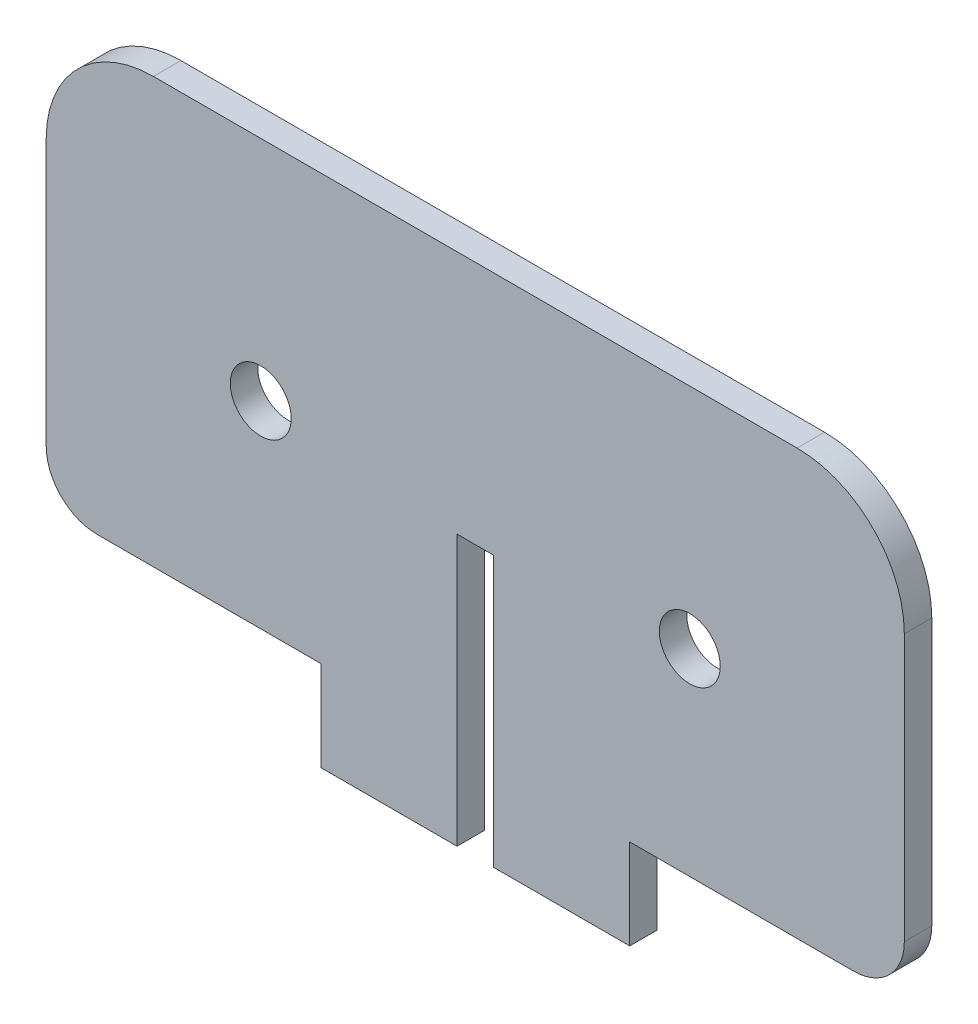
ISO-10303-21;
HEADER;
FILE_DESCRIPTION(('STEP AP214'),'2;1');
FILE_NAME('part.step','',(''),(''),'','','');
FILE_SCHEMA(('AUTOMOTIVE_DESIGN { 1 0 10303 214 1 1 1 1 }'));
ENDSEC;
DATA;
#1=APPLICATION_CONTEXT('core data for automotive mechanical design processes');
#2=APPLICATION_PROTOCOL_DEFINITION('international standard','automotive_design',2000,#1);
#3=PRODUCT_CONTEXT('',#1,'mechanical');
#4=PRODUCT('Part','Part','',(#3));
#5=PRODUCT_RELATED_PRODUCT_CATEGORY('part','',(#4));
#6=PRODUCT_DEFINITION_FORMATION('','',#4);
#7=PRODUCT_DEFINITION_CONTEXT('part definition',#1,'design');
#8=PRODUCT_DEFINITION('design','',#6,#7);
#9=PRODUCT_DEFINITION_SHAPE('','',#8);
#10=(LENGTH_UNIT() NAMED_UNIT(*) SI_UNIT(.MILLI.,.METRE.));
#11=(NAMED_UNIT(*) PLANE_ANGLE_UNIT() SI_UNIT($,.RADIAN.));
#12=(NAMED_UNIT(*) SI_UNIT($,.STERADIAN.) SOLID_ANGLE_UNIT());
#13=UNCERTAINTY_MEASURE_WITH_UNIT(LENGTH_MEASURE(1.E-05),#10,'distance_accuracy_value','');
#14=(GEOMETRIC_REPRESENTATION_CONTEXT(3) GLOBAL_UNCERTAINTY_ASSIGNED_CONTEXT((#13)) GLOBAL_UNIT_ASSIGNED_CONTEXT((#10,
#11,#12)) REPRESENTATION_CONTEXT('',''));
#15=CARTESIAN_POINT('',(0.,0.,0.));
#16=DIRECTION('',(0.,0.,1.));
#17=DIRECTION('',(1.,0.,0.));
#18=AXIS2_PLACEMENT_3D('',#15,#16,#17);
#19=CARTESIAN_POINT('',(11.8472976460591,28.8472976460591,-6.4));
#20=DIRECTION('',(0.,0.,1.));
#21=DIRECTION('',(1.,0.,0.));
#22=AXIS2_PLACEMENT_3D('',#19,#20,#21);
#23=CYLINDRICAL_SURFACE('',#22,11.8472976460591);
#24=CARTESIAN_POINT('',(11.8472976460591,28.8472976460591,0.));
#25=DIRECTION('',(0.,0.,1.));
#26=DIRECTION('',(1.,0.,0.));
#27=AXIS2_PLACEMENT_3D('',#24,#25,#26);
#28=CIRCLE('',#27,11.8472976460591);
#29=CARTESIAN_POINT('',(0.,28.8472976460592,0.));
#30=VERTEX_POINT('',#29);
#31=CARTESIAN_POINT('',(11.8472976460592,17.,0.));
#32=VERTEX_POINT('',#31);
#33=EDGE_CURVE('E178',#30,#32,#28,.T.);
#34=ORIENTED_EDGE('',*,*,#33,.F.);
#35=DIRECTION('',(0.,0.,1.));
#36=VECTOR('',#35,1.);
#37=CARTESIAN_POINT('',(0.,28.8472976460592,-6.4));
#38=LINE('',#37,#36);
#39=CARTESIAN_POINT('',(0.,28.8472976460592,-6.4));
#40=VERTEX_POINT('',#39);
#41=EDGE_CURVE('E11',#40,#30,#38,.T.);
#42=ORIENTED_EDGE('',*,*,#41,.F.);
#43=CARTESIAN_POINT('',(11.8472976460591,28.8472976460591,-6.4));
#44=DIRECTION('',(0.,0.,1.));
#45=DIRECTION('',(1.,0.,0.));
#46=AXIS2_PLACEMENT_3D('',#43,#44,#45);
#47=CIRCLE('',#46,11.8472976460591);
#48=CARTESIAN_POINT('',(11.8472976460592,17.,-6.4));
#49=VERTEX_POINT('',#48);
#50=EDGE_CURVE('E223',#40,#49,#47,.T.);
#51=ORIENTED_EDGE('',*,*,#50,.T.);
#52=DIRECTION('',(0.,0.,1.));
#53=VECTOR('',#52,1.);
#54=CARTESIAN_POINT('',(11.8472976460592,17.,-6.4));
#55=LINE('',#54,#53);
#56=EDGE_CURVE('E36',#49,#32,#55,.T.);
#57=ORIENTED_EDGE('',*,*,#56,.T.);
#58=EDGE_LOOP('',(#34,#42,#51,#57));
#59=FACE_BOUND('',#58,.T.);
#60=ADVANCED_FACE('F33',(#59),#23,.T.);
#61=CARTESIAN_POINT('',(0.,28.8472976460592,-6.4));
#62=DIRECTION('',(-1.,0.,0.));
#63=DIRECTION('',(0.,0.,1.));
#64=AXIS2_PLACEMENT_3D('',#61,#62,#63);
#65=PLANE('',#64);
#66=DIRECTION('',(0.,-1.,0.));
#67=VECTOR('',#66,1.);
#68=CARTESIAN_POINT('',(0.,28.8472976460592,0.));
#69=LINE('',#68,#67);
#70=CARTESIAN_POINT('',(0.,91.,0.));
#71=VERTEX_POINT('',#70);
#72=EDGE_CURVE('E221',#71,#30,#69,.T.);
#73=ORIENTED_EDGE('',*,*,#72,.F.);
#74=DIRECTION('',(0.,0.,1.));
#75=VECTOR('',#74,1.);
#76=CARTESIAN_POINT('',(0.,91.,-6.4));
#77=LINE('',#76,#75);
#78=CARTESIAN_POINT('',(0.,91.,-6.4));
#79=VERTEX_POINT('',#78);
#80=EDGE_CURVE('E42',#79,#71,#77,.T.);
#81=ORIENTED_EDGE('',*,*,#80,.F.);
#82=DIRECTION('',(0.,-1.,0.));
#83=VECTOR('',#82,1.);
#84=CARTESIAN_POINT('',(0.,28.8472976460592,-6.4));
#85=LINE('',#84,#83);
#86=EDGE_CURVE('E168',#79,#40,#85,.T.);
#87=ORIENTED_EDGE('',*,*,#86,.T.);
#88=ORIENTED_EDGE('',*,*,#41,.T.);
#89=EDGE_LOOP('',(#73,#81,#87,#88));
#90=FACE_BOUND('',#89,.T.);
#91=ADVANCED_FACE('F251',(#90),#65,.T.);
#92=CARTESIAN_POINT('',(25.0000001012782,90.9999998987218,-6.4));
#93=DIRECTION('',(0.,0.,1.));
#94=DIRECTION('',(1.,0.,0.));
#95=AXIS2_PLACEMENT_3D('',#92,#93,#94);
#96=CYLINDRICAL_SURFACE('',#95,25.0000001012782);
#97=CARTESIAN_POINT('',(25.0000001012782,90.9999998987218,0.));
#98=DIRECTION('',(0.,0.,1.));
#99=DIRECTION('',(1.,0.,0.));
#100=AXIS2_PLACEMENT_3D('',#97,#98,#99);
#101=CIRCLE('',#100,25.0000001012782);
#102=CARTESIAN_POINT('',(25.,116.,0.));
#103=VERTEX_POINT('',#102);
#104=EDGE_CURVE('E155',#103,#71,#101,.T.);
#105=ORIENTED_EDGE('',*,*,#104,.F.);
#106=DIRECTION('',(0.,0.,1.));
#107=VECTOR('',#106,1.);
#108=CARTESIAN_POINT('',(25.,116.,-6.4));
#109=LINE('',#108,#107);
#110=CARTESIAN_POINT('',(25.,116.,-6.4));
#111=VERTEX_POINT('',#110);
#112=EDGE_CURVE('E150',#111,#103,#109,.T.);
#113=ORIENTED_EDGE('',*,*,#112,.F.);
#114=CARTESIAN_POINT('',(25.0000001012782,90.9999998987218,-6.4));
#115=DIRECTION('',(0.,0.,1.));
#116=DIRECTION('',(1.,0.,0.));
#117=AXIS2_PLACEMENT_3D('',#114,#115,#116);
#118=CIRCLE('',#117,25.0000001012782);
#119=EDGE_CURVE('E153',#111,#79,#118,.T.);
#120=ORIENTED_EDGE('',*,*,#119,.T.);
#121=ORIENTED_EDGE('',*,*,#80,.T.);
#122=EDGE_LOOP('',(#105,#113,#120,#121));
#123=FACE_BOUND('',#122,.T.);
#124=ADVANCED_FACE('F152',(#123),#96,.T.);
#125=CARTESIAN_POINT('',(25.,116.,-6.4));
#126=DIRECTION('',(0.,1.,0.));
#127=DIRECTION('',(0.,0.,1.));
#128=AXIS2_PLACEMENT_3D('',#125,#126,#127);
#129=PLANE('',#128);
#130=DIRECTION('',(-1.,0.,0.));
#131=VECTOR('',#130,1.);
#132=CARTESIAN_POINT('',(25.,116.,0.));
#133=LINE('',#132,#131);
#134=CARTESIAN_POINT('',(175.,116.,0.));
#135=VERTEX_POINT('',#134);
#136=EDGE_CURVE('E218',#135,#103,#133,.T.);
#137=ORIENTED_EDGE('',*,*,#136,.F.);
#138=DIRECTION('',(0.,0.,1.));
#139=VECTOR('',#138,1.);
#140=CARTESIAN_POINT('',(175.,116.,-6.4));
#141=LINE('',#140,#139);
#142=CARTESIAN_POINT('',(175.,116.,-6.4));
#143=VERTEX_POINT('',#142);
#144=EDGE_CURVE('E160',#143,#135,#141,.T.);
#145=ORIENTED_EDGE('',*,*,#144,.F.);
#146=DIRECTION('',(-1.,0.,0.));
#147=VECTOR('',#146,1.);
#148=CARTESIAN_POINT('',(25.,116.,-6.4));
#149=LINE('',#148,#147);
#150=EDGE_CURVE('E166',#143,#111,#149,.T.);
#151=ORIENTED_EDGE('',*,*,#150,.T.);
#152=ORIENTED_EDGE('',*,*,#112,.T.);
#153=EDGE_LOOP('',(#137,#145,#151,#152));
#154=FACE_BOUND('',#153,.T.);
#155=ADVANCED_FACE('F170',(#154),#129,.T.);
#156=CARTESIAN_POINT('',(174.999999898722,90.9999998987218,-6.4));
#157=DIRECTION('',(0.,0.,1.));
#158=DIRECTION('',(1.,0.,0.));
#159=AXIS2_PLACEMENT_3D('',#156,#157,#158);
#160=CYLINDRICAL_SURFACE('',#159,25.0000001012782);
#161=CARTESIAN_POINT('',(174.999999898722,90.9999998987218,0.));
#162=DIRECTION('',(0.,0.,1.));
#163=DIRECTION('',(1.,0.,0.));
#164=AXIS2_PLACEMENT_3D('',#161,#162,#163);
#165=CIRCLE('',#164,25.0000001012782);
#166=CARTESIAN_POINT('',(200.,91.,0.));
#167=VERTEX_POINT('',#166);
#168=EDGE_CURVE('E215',#167,#135,#165,.T.);
#169=ORIENTED_EDGE('',*,*,#168,.F.);
#170=DIRECTION('',(0.,0.,1.));
#171=VECTOR('',#170,1.);
#172=CARTESIAN_POINT('',(200.,91.,-6.4));
#173=LINE('',#172,#171);
#174=CARTESIAN_POINT('',(200.,91.,-6.4));
#175=VERTEX_POINT('',#174);
#176=EDGE_CURVE('E227',#175,#167,#173,.T.);
#177=ORIENTED_EDGE('',*,*,#176,.F.);
#178=CARTESIAN_POINT('',(174.999999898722,90.9999998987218,-6.4));
#179=DIRECTION('',(0.,0.,1.));
#180=DIRECTION('',(1.,0.,0.));
#181=AXIS2_PLACEMENT_3D('',#178,#179,#180);
#182=CIRCLE('',#181,25.0000001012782);
#183=EDGE_CURVE('E171',#175,#143,#182,.T.);
#184=ORIENTED_EDGE('',*,*,#183,.T.);
#185=ORIENTED_EDGE('',*,*,#144,.T.);
#186=EDGE_LOOP('',(#169,#177,#184,#185));
#187=FACE_BOUND('',#186,.T.);
#188=ADVANCED_FACE('F264',(#187),#160,.T.);
#189=CARTESIAN_POINT('',(200.,91.,-6.4));
#190=DIRECTION('',(1.,0.,0.));
#191=DIRECTION('',(0.,0.,-1.));
#192=AXIS2_PLACEMENT_3D('',#189,#190,#191);
#193=PLANE('',#192);
#194=DIRECTION('',(0.,1.,0.));
#195=VECTOR('',#194,1.);
#196=CARTESIAN_POINT('',(200.,91.,0.));
#197=LINE('',#196,#195);
#198=CARTESIAN_POINT('',(200.,28.8472976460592,0.));
#199=VERTEX_POINT('',#198);
#200=EDGE_CURVE('E212',#199,#167,#197,.T.);
#201=ORIENTED_EDGE('',*,*,#200,.F.);
#202=DIRECTION('',(0.,0.,1.));
#203=VECTOR('',#202,1.);
#204=CARTESIAN_POINT('',(200.,28.8472976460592,-6.4));
#205=LINE('',#204,#203);
#206=CARTESIAN_POINT('',(200.,28.8472976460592,-6.4));
#207=VERTEX_POINT('',#206);
#208=EDGE_CURVE('E229',#207,#199,#205,.T.);
#209=ORIENTED_EDGE('',*,*,#208,.F.);
#210=DIRECTION('',(0.,1.,0.));
#211=VECTOR('',#210,1.);
#212=CARTESIAN_POINT('',(200.,91.,-6.4));
#213=LINE('',#212,#211);
#214=EDGE_CURVE('E173',#207,#175,#213,.T.);
#215=ORIENTED_EDGE('',*,*,#214,.T.);
#216=ORIENTED_EDGE('',*,*,#176,.T.);
#217=EDGE_LOOP('',(#201,#209,#215,#216));
#218=FACE_BOUND('',#217,.T.);
#219=ADVANCED_FACE('F267',(#218),#193,.T.);
#220=CARTESIAN_POINT('',(188.152702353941,28.8472976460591,-6.4));
#221=DIRECTION('',(0.,0.,1.));
#222=DIRECTION('',(1.,0.,0.));
#223=AXIS2_PLACEMENT_3D('',#220,#221,#222);
#224=CYLINDRICAL_SURFACE('',#223,11.8472976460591);
#225=CARTESIAN_POINT('',(188.152702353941,28.8472976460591,0.));
#226=DIRECTION('',(0.,0.,1.));
#227=DIRECTION('',(-1.,0.,0.));
#228=AXIS2_PLACEMENT_3D('',#225,#226,#227);
#229=CIRCLE('',#228,11.8472976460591);
#230=CARTESIAN_POINT('',(188.152702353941,17.,0.));
#231=VERTEX_POINT('',#230);
#232=EDGE_CURVE('E209',#231,#199,#229,.T.);
#233=ORIENTED_EDGE('',*,*,#232,.F.);
#234=DIRECTION('',(0.,0.,1.));
#235=VECTOR('',#234,1.);
#236=CARTESIAN_POINT('',(188.152702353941,17.,-6.4));
#237=LINE('',#236,#235);
#238=CARTESIAN_POINT('',(188.152702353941,17.,-6.4));
#239=VERTEX_POINT('',#238);
#240=EDGE_CURVE('E231',#239,#231,#237,.T.);
#241=ORIENTED_EDGE('',*,*,#240,.F.);
#242=CARTESIAN_POINT('',(188.152702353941,28.8472976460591,-6.4));
#243=DIRECTION('',(0.,0.,1.));
#244=DIRECTION('',(-1.,0.,0.));
#245=AXIS2_PLACEMENT_3D('',#242,#243,#244);
#246=CIRCLE('',#245,11.8472976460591);
#247=EDGE_CURVE('E369',#239,#207,#246,.T.);
#248=ORIENTED_EDGE('',*,*,#247,.T.);
#249=ORIENTED_EDGE('',*,*,#208,.T.);
#250=EDGE_LOOP('',(#233,#241,#248,#249));
#251=FACE_BOUND('',#250,.T.);
#252=ADVANCED_FACE('F271',(#251),#224,.T.);
#253=CARTESIAN_POINT('',(188.152702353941,17.,-6.4));
#254=DIRECTION('',(0.,-1.,0.));
#255=DIRECTION('',(0.,0.,-1.));
#256=AXIS2_PLACEMENT_3D('',#253,#254,#255);
#257=PLANE('',#256);
#258=DIRECTION('',(1.,0.,0.));
#259=VECTOR('',#258,1.);
#260=CARTESIAN_POINT('',(188.152702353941,17.,0.));
#261=LINE('',#260,#259);
#262=CARTESIAN_POINT('',(136.,17.,0.));
#263=VERTEX_POINT('',#262);
#264=EDGE_CURVE('E206',#263,#231,#261,.T.);
#265=ORIENTED_EDGE('',*,*,#264,.F.);
#266=DIRECTION('',(0.,0.,1.));
#267=VECTOR('',#266,1.);
#268=CARTESIAN_POINT('',(136.,17.,-6.4));
#269=LINE('',#268,#267);
#270=CARTESIAN_POINT('',(136.,17.,-6.4));
#271=VERTEX_POINT('',#270);
#272=EDGE_CURVE('E233',#271,#263,#269,.T.);
#273=ORIENTED_EDGE('',*,*,#272,.F.);
#274=DIRECTION('',(1.,0.,0.));
#275=VECTOR('',#274,1.);
#276=CARTESIAN_POINT('',(188.152702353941,17.,-6.4));
#277=LINE('',#276,#275);
#278=EDGE_CURVE('E366',#271,#239,#277,.T.);
#279=ORIENTED_EDGE('',*,*,#278,.T.);
#280=ORIENTED_EDGE('',*,*,#240,.T.);
#281=EDGE_LOOP('',(#265,#273,#279,#280));
#282=FACE_BOUND('',#281,.T.);
#283=ADVANCED_FACE('F275',(#282),#257,.T.);
#284=CARTESIAN_POINT('',(136.,17.,-6.4));
#285=DIRECTION('',(1.,0.,0.));
#286=DIRECTION('',(0.,0.,-1.));
#287=AXIS2_PLACEMENT_3D('',#284,#285,#286);
#288=PLANE('',#287);
#289=DIRECTION('',(0.,1.,0.));
#290=VECTOR('',#289,1.);
#291=CARTESIAN_POINT('',(136.,17.,0.));
#292=LINE('',#291,#290);
#293=CARTESIAN_POINT('',(136.,-4.,0.));
#294=VERTEX_POINT('',#293);
#295=EDGE_CURVE('E203',#294,#263,#292,.T.);
#296=ORIENTED_EDGE('',*,*,#295,.F.);
#297=DIRECTION('',(0.,0.,1.));
#298=VECTOR('',#297,1.);
#299=CARTESIAN_POINT('',(136.,-4.,-6.4));
#300=LINE('',#299,#298);
#301=CARTESIAN_POINT('',(136.,-4.,-6.4));
#302=VERTEX_POINT('',#301);
#303=EDGE_CURVE('E235',#302,#294,#300,.T.);
#304=ORIENTED_EDGE('',*,*,#303,.F.);
#305=DIRECTION('',(0.,1.,0.));
#306=VECTOR('',#305,1.);
#307=CARTESIAN_POINT('',(136.,17.,-6.4));
#308=LINE('',#307,#306);
#309=EDGE_CURVE('E363',#302,#271,#308,.T.);
#310=ORIENTED_EDGE('',*,*,#309,.T.);
#311=ORIENTED_EDGE('',*,*,#272,.T.);
#312=EDGE_LOOP('',(#296,#304,#310,#311));
#313=FACE_BOUND('',#312,.T.);
#314=ADVANCED_FACE('F279',(#313),#288,.T.);
#315=CARTESIAN_POINT('',(136.,-4.,-6.4));
#316=DIRECTION('',(0.,-1.,0.));
#317=DIRECTION('',(1.,0.,0.));
#318=AXIS2_PLACEMENT_3D('',#315,#316,#317);
#319=PLANE('',#318);
#320=DIRECTION('',(1.,0.,0.));
#321=VECTOR('',#320,1.);
#322=CARTESIAN_POINT('',(136.,-4.,0.));
#323=LINE('',#322,#321);
#324=CARTESIAN_POINT('',(104.25,-4.,0.));
#325=VERTEX_POINT('',#324);
#326=EDGE_CURVE('E200',#325,#294,#323,.T.);
#327=ORIENTED_EDGE('',*,*,#326,.F.);
#328=DIRECTION('',(0.,0.,1.));
#329=VECTOR('',#328,1.);
#330=CARTESIAN_POINT('',(104.25,-4.,-6.4));
#331=LINE('',#330,#329);
#332=CARTESIAN_POINT('',(104.25,-4.,-6.4));
#333=VERTEX_POINT('',#332);
#334=EDGE_CURVE('E237',#333,#325,#331,.T.);
#335=ORIENTED_EDGE('',*,*,#334,.F.);
#336=DIRECTION('',(1.,0.,0.));
#337=VECTOR('',#336,1.);
#338=CARTESIAN_POINT('',(136.,-4.,-6.4));
#339=LINE('',#338,#337);
#340=EDGE_CURVE('E360',#333,#302,#339,.T.);
#341=ORIENTED_EDGE('',*,*,#340,.T.);
#342=ORIENTED_EDGE('',*,*,#303,.T.);
#343=EDGE_LOOP('',(#327,#335,#341,#342));
#344=FACE_BOUND('',#343,.T.);
#345=ADVANCED_FACE('F283',(#344),#319,.T.);
#346=CARTESIAN_POINT('',(104.25,-4.,-6.4));
#347=DIRECTION('',(-1.,0.,0.));
#348=DIRECTION('',(0.,0.,1.));
#349=AXIS2_PLACEMENT_3D('',#346,#347,#348);
#350=PLANE('',#349);
#351=DIRECTION('',(0.,-1.,0.));
#352=VECTOR('',#351,1.);
#353=CARTESIAN_POINT('',(104.25,-4.,0.));
#354=LINE('',#353,#352);
#355=CARTESIAN_POINT('',(104.25,59.,0.));
#356=VERTEX_POINT('',#355);
#357=EDGE_CURVE('E197',#356,#325,#354,.T.);
#358=ORIENTED_EDGE('',*,*,#357,.F.);
#359=DIRECTION('',(0.,0.,1.));
#360=VECTOR('',#359,1.);
#361=CARTESIAN_POINT('',(104.25,59.,-6.4));
#362=LINE('',#361,#360);
#363=CARTESIAN_POINT('',(104.25,59.,-6.4));
#364=VERTEX_POINT('',#363);
#365=EDGE_CURVE('E239',#364,#356,#362,.T.);
#366=ORIENTED_EDGE('',*,*,#365,.F.);
#367=DIRECTION('',(0.,-1.,0.));
#368=VECTOR('',#367,1.);
#369=CARTESIAN_POINT('',(104.25,-4.,-6.4));
#370=LINE('',#369,#368);
#371=EDGE_CURVE('E357',#364,#333,#370,.T.);
#372=ORIENTED_EDGE('',*,*,#371,.T.);
#373=ORIENTED_EDGE('',*,*,#334,.T.);
#374=EDGE_LOOP('',(#358,#366,#372,#373));
#375=FACE_BOUND('',#374,.T.);
#376=ADVANCED_FACE('F287',(#375),#350,.T.);
#377=CARTESIAN_POINT('',(104.25,59.,-6.4));
#378=DIRECTION('',(0.,-1.,0.));
#379=DIRECTION('',(0.,0.,-1.));
#380=AXIS2_PLACEMENT_3D('',#377,#378,#379);
#381=PLANE('',#380);
#382=DIRECTION('',(1.,0.,0.));
#383=VECTOR('',#382,1.);
#384=CARTESIAN_POINT('',(104.25,59.,0.));
#385=LINE('',#384,#383);
#386=CARTESIAN_POINT('',(95.75,59.,0.));
#387=VERTEX_POINT('',#386);
#388=EDGE_CURVE('E194',#387,#356,#385,.T.);
#389=ORIENTED_EDGE('',*,*,#388,.F.);
#390=DIRECTION('',(0.,0.,1.));
#391=VECTOR('',#390,1.);
#392=CARTESIAN_POINT('',(95.75,59.,-6.4));
#393=LINE('',#392,#391);
#394=CARTESIAN_POINT('',(95.75,59.,-6.4));
#395=VERTEX_POINT('',#394);
#396=EDGE_CURVE('E241',#395,#387,#393,.T.);
#397=ORIENTED_EDGE('',*,*,#396,.F.);
#398=DIRECTION('',(1.,0.,0.));
#399=VECTOR('',#398,1.);
#400=CARTESIAN_POINT('',(104.25,59.,-6.4));
#401=LINE('',#400,#399);
#402=EDGE_CURVE('E354',#395,#364,#401,.T.);
#403=ORIENTED_EDGE('',*,*,#402,.T.);
#404=ORIENTED_EDGE('',*,*,#365,.T.);
#405=EDGE_LOOP('',(#389,#397,#403,#404));
#406=FACE_BOUND('',#405,.T.);
#407=ADVANCED_FACE('F291',(#406),#381,.T.);
#408=CARTESIAN_POINT('',(95.75,59.,-6.4));
#409=DIRECTION('',(1.,0.,0.));
#410=DIRECTION('',(0.,0.,-1.));
#411=AXIS2_PLACEMENT_3D('',#408,#409,#410);
#412=PLANE('',#411);
#413=DIRECTION('',(0.,1.,0.));
#414=VECTOR('',#413,1.);
#415=CARTESIAN_POINT('',(95.75,59.,0.));
#416=LINE('',#415,#414);
#417=CARTESIAN_POINT('',(95.75,-4.,0.));
#418=VERTEX_POINT('',#417);
#419=EDGE_CURVE('E191',#418,#387,#416,.T.);
#420=ORIENTED_EDGE('',*,*,#419,.F.);
#421=DIRECTION('',(0.,0.,1.));
#422=VECTOR('',#421,1.);
#423=CARTESIAN_POINT('',(95.75,-4.,-6.4));
#424=LINE('',#423,#422);
#425=CARTESIAN_POINT('',(95.75,-4.,-6.4));
#426=VERTEX_POINT('',#425);
#427=EDGE_CURVE('E243',#426,#418,#424,.T.);
#428=ORIENTED_EDGE('',*,*,#427,.F.);
#429=DIRECTION('',(0.,1.,0.));
#430=VECTOR('',#429,1.);
#431=CARTESIAN_POINT('',(95.75,59.,-6.4));
#432=LINE('',#431,#430);
#433=EDGE_CURVE('E351',#426,#395,#432,.T.);
#434=ORIENTED_EDGE('',*,*,#433,.T.);
#435=ORIENTED_EDGE('',*,*,#396,.T.);
#436=EDGE_LOOP('',(#420,#428,#434,#435));
#437=FACE_BOUND('',#436,.T.);
#438=ADVANCED_FACE('F295',(#437),#412,.T.);
#439=CARTESIAN_POINT('',(95.75,-4.,-6.4));
#440=DIRECTION('',(0.,-1.,0.));
#441=DIRECTION('',(1.,0.,0.));
#442=AXIS2_PLACEMENT_3D('',#439,#440,#441);
#443=PLANE('',#442);
#444=DIRECTION('',(1.,0.,0.));
#445=VECTOR('',#444,1.);
#446=CARTESIAN_POINT('',(95.75,-4.,0.));
#447=LINE('',#446,#445);
#448=CARTESIAN_POINT('',(64.,-4.00000000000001,0.));
#449=VERTEX_POINT('',#448);
#450=EDGE_CURVE('E188',#449,#418,#447,.T.);
#451=ORIENTED_EDGE('',*,*,#450,.F.);
#452=DIRECTION('',(0.,0.,1.));
#453=VECTOR('',#452,1.);
#454=CARTESIAN_POINT('',(64.,-4.00000000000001,-6.4));
#455=LINE('',#454,#453);
#456=CARTESIAN_POINT('',(64.,-4.00000000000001,-6.4));
#457=VERTEX_POINT('',#456);
#458=EDGE_CURVE('E245',#457,#449,#455,.T.);
#459=ORIENTED_EDGE('',*,*,#458,.F.);
#460=DIRECTION('',(1.,0.,0.));
#461=VECTOR('',#460,1.);
#462=CARTESIAN_POINT('',(95.75,-4.,-6.4));
#463=LINE('',#462,#461);
#464=EDGE_CURVE('E348',#457,#426,#463,.T.);
#465=ORIENTED_EDGE('',*,*,#464,.T.);
#466=ORIENTED_EDGE('',*,*,#427,.T.);
#467=EDGE_LOOP('',(#451,#459,#465,#466));
#468=FACE_BOUND('',#467,.T.);
#469=ADVANCED_FACE('F299',(#468),#443,.T.);
#470=CARTESIAN_POINT('',(64.,-4.00000000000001,-6.4));
#471=DIRECTION('',(-1.,0.,0.));
#472=DIRECTION('',(0.,0.,1.));
#473=AXIS2_PLACEMENT_3D('',#470,#471,#472);
#474=PLANE('',#473);
#475=DIRECTION('',(0.,-1.,0.));
#476=VECTOR('',#475,1.);
#477=CARTESIAN_POINT('',(64.,-4.00000000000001,0.));
#478=LINE('',#477,#476);
#479=CARTESIAN_POINT('',(64.,17.,0.));
#480=VERTEX_POINT('',#479);
#481=EDGE_CURVE('E185',#480,#449,#478,.T.);
#482=ORIENTED_EDGE('',*,*,#481,.F.);
#483=DIRECTION('',(0.,0.,1.));
#484=VECTOR('',#483,1.);
#485=CARTESIAN_POINT('',(64.,17.,-6.4));
#486=LINE('',#485,#484);
#487=CARTESIAN_POINT('',(64.,17.,-6.4));
#488=VERTEX_POINT('',#487);
#489=EDGE_CURVE('E246',#488,#480,#486,.T.);
#490=ORIENTED_EDGE('',*,*,#489,.F.);
#491=DIRECTION('',(0.,-1.,0.));
#492=VECTOR('',#491,1.);
#493=CARTESIAN_POINT('',(64.,-4.00000000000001,-6.4));
#494=LINE('',#493,#492);
#495=EDGE_CURVE('E345',#488,#457,#494,.T.);
#496=ORIENTED_EDGE('',*,*,#495,.T.);
#497=ORIENTED_EDGE('',*,*,#458,.T.);
#498=EDGE_LOOP('',(#482,#490,#496,#497));
#499=FACE_BOUND('',#498,.T.);
#500=ADVANCED_FACE('F303',(#499),#474,.T.);
#501=CARTESIAN_POINT('',(64.,17.,-6.4));
#502=DIRECTION('',(0.,-1.,0.));
#503=DIRECTION('',(0.,0.,-1.));
#504=AXIS2_PLACEMENT_3D('',#501,#502,#503);
#505=PLANE('',#504);
#506=DIRECTION('',(1.,0.,0.));
#507=VECTOR('',#506,1.);
#508=CARTESIAN_POINT('',(64.,17.,0.));
#509=LINE('',#508,#507);
#510=EDGE_CURVE('E181',#32,#480,#509,.T.);
#511=ORIENTED_EDGE('',*,*,#510,.F.);
#512=ORIENTED_EDGE('',*,*,#56,.F.);
#513=DIRECTION('',(1.,0.,0.));
#514=VECTOR('',#513,1.);
#515=CARTESIAN_POINT('',(64.,17.,-6.4));
#516=LINE('',#515,#514);
#517=EDGE_CURVE('E343',#49,#488,#516,.T.);
#518=ORIENTED_EDGE('',*,*,#517,.T.);
#519=ORIENTED_EDGE('',*,*,#489,.T.);
#520=EDGE_LOOP('',(#511,#512,#518,#519));
#521=FACE_BOUND('',#520,.T.);
#522=ADVANCED_FACE('F248',(#521),#505,.T.);
#523=CARTESIAN_POINT('',(11.8472976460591,28.8472976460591,-6.4));
#524=DIRECTION('',(0.,0.,1.));
#525=DIRECTION('',(1.,0.,0.));
#526=AXIS2_PLACEMENT_3D('',#523,#524,#525);
#527=PLANE('',#526);
#528=CARTESIAN_POINT('',(150.,63.,-6.4));
#529=DIRECTION('',(0.,0.,1.));
#530=DIRECTION('',(1.,0.,0.));
#531=AXIS2_PLACEMENT_3D('',#528,#529,#530);
#532=CIRCLE('',#531,7.1);
#533=CARTESIAN_POINT('',(157.1,63.,-6.4));
#534=VERTEX_POINT('',#533);
#535=EDGE_CURVE('E330',#534,#534,#532,.T.);
#536=ORIENTED_EDGE('',*,*,#535,.T.);
#537=EDGE_LOOP('',(#536));
#538=FACE_BOUND('',#537,.T.);
#539=CARTESIAN_POINT('',(50.,63.,-6.4));
#540=DIRECTION('',(0.,0.,1.));
#541=DIRECTION('',(1.,0.,0.));
#542=AXIS2_PLACEMENT_3D('',#539,#540,#541);
#543=CIRCLE('',#542,7.1);
#544=CARTESIAN_POINT('',(57.1,63.,-6.4));
#545=VERTEX_POINT('',#544);
#546=EDGE_CURVE('E182',#545,#545,#543,.T.);
#547=ORIENTED_EDGE('',*,*,#546,.T.);
#548=EDGE_LOOP('',(#547));
#549=FACE_BOUND('',#548,.T.);
#550=ORIENTED_EDGE('',*,*,#50,.F.);
#551=ORIENTED_EDGE('',*,*,#86,.F.);
#552=ORIENTED_EDGE('',*,*,#119,.F.);
#553=ORIENTED_EDGE('',*,*,#150,.F.);
#554=ORIENTED_EDGE('',*,*,#183,.F.);
#555=ORIENTED_EDGE('',*,*,#214,.F.);
#556=ORIENTED_EDGE('',*,*,#247,.F.);
#557=ORIENTED_EDGE('',*,*,#278,.F.);
#558=ORIENTED_EDGE('',*,*,#309,.F.);
#559=ORIENTED_EDGE('',*,*,#340,.F.);
#560=ORIENTED_EDGE('',*,*,#371,.F.);
#561=ORIENTED_EDGE('',*,*,#402,.F.);
#562=ORIENTED_EDGE('',*,*,#433,.F.);
#563=ORIENTED_EDGE('',*,*,#464,.F.);
#564=ORIENTED_EDGE('',*,*,#495,.F.);
#565=ORIENTED_EDGE('',*,*,#517,.F.);
#566=EDGE_LOOP('',(#550,#551,#552,#553,#554,#555,#556,#557,#558,#559,#560,#561,#562,#563,#564,#565));
#567=FACE_BOUND('',#566,.T.);
#568=ADVANCED_FACE('F164',(#538,#549,#567),#527,.F.);
#569=CARTESIAN_POINT('',(11.8472976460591,28.8472976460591,0.));
#570=DIRECTION('',(0.,0.,1.));
#571=DIRECTION('',(1.,0.,0.));
#572=AXIS2_PLACEMENT_3D('',#569,#570,#571);
#573=PLANE('',#572);
#574=CARTESIAN_POINT('',(150.,63.,0.));
#575=DIRECTION('',(0.,0.,1.));
#576=DIRECTION('',(1.,0.,0.));
#577=AXIS2_PLACEMENT_3D('',#574,#575,#576);
#578=CIRCLE('',#577,7.1);
#579=CARTESIAN_POINT('',(157.1,63.,0.));
#580=VERTEX_POINT('',#579);
#581=EDGE_CURVE('E333',#580,#580,#578,.T.);
#582=ORIENTED_EDGE('',*,*,#581,.F.);
#583=EDGE_LOOP('',(#582));
#584=FACE_BOUND('',#583,.T.);
#585=CARTESIAN_POINT('',(50.,63.,0.));
#586=DIRECTION('',(0.,0.,1.));
#587=DIRECTION('',(1.,0.,0.));
#588=AXIS2_PLACEMENT_3D('',#585,#586,#587);
#589=CIRCLE('',#588,7.1);
#590=CARTESIAN_POINT('',(57.1,63.,0.));
#591=VERTEX_POINT('',#590);
#592=EDGE_CURVE('E335',#591,#591,#589,.T.);
#593=ORIENTED_EDGE('',*,*,#592,.F.);
#594=EDGE_LOOP('',(#593));
#595=FACE_BOUND('',#594,.T.);
#596=ORIENTED_EDGE('',*,*,#33,.T.);
#597=ORIENTED_EDGE('',*,*,#510,.T.);
#598=ORIENTED_EDGE('',*,*,#481,.T.);
#599=ORIENTED_EDGE('',*,*,#450,.T.);
#600=ORIENTED_EDGE('',*,*,#419,.T.);
#601=ORIENTED_EDGE('',*,*,#388,.T.);
#602=ORIENTED_EDGE('',*,*,#357,.T.);
#603=ORIENTED_EDGE('',*,*,#326,.T.);
#604=ORIENTED_EDGE('',*,*,#295,.T.);
#605=ORIENTED_EDGE('',*,*,#264,.T.);
#606=ORIENTED_EDGE('',*,*,#232,.T.);
#607=ORIENTED_EDGE('',*,*,#200,.T.);
#608=ORIENTED_EDGE('',*,*,#168,.T.);
#609=ORIENTED_EDGE('',*,*,#136,.T.);
#610=ORIENTED_EDGE('',*,*,#104,.T.);
#611=ORIENTED_EDGE('',*,*,#72,.T.);
#612=EDGE_LOOP('',(#596,#597,#598,#599,#600,#601,#602,#603,#604,#605,#606,#607,#608,#609,#610,#611));
#613=FACE_BOUND('',#612,.T.);
#614=ADVANCED_FACE('F250',(#584,#595,#613),#573,.T.);
#615=CARTESIAN_POINT('',(50.,63.,-6.4));
#616=DIRECTION('',(0.,0.,1.));
#617=DIRECTION('',(1.,0.,0.));
#618=AXIS2_PLACEMENT_3D('',#615,#616,#617);
#619=CYLINDRICAL_SURFACE('',#618,7.1);
#620=ORIENTED_EDGE('',*,*,#546,.F.);
#621=EDGE_LOOP('',(#620));
#622=FACE_BOUND('',#621,.T.);
#623=ORIENTED_EDGE('',*,*,#592,.T.);
#624=EDGE_LOOP('',(#623));
#625=FACE_BOUND('',#624,.T.);
#626=ADVANCED_FACE('F315',(#622,#625),#619,.F.);
#627=CARTESIAN_POINT('',(150.,63.,-6.4));
#628=DIRECTION('',(0.,0.,1.));
#629=DIRECTION('',(1.,0.,0.));
#630=AXIS2_PLACEMENT_3D('',#627,#628,#629);
#631=CYLINDRICAL_SURFACE('',#630,7.1);
#632=ORIENTED_EDGE('',*,*,#535,.F.);
#633=EDGE_LOOP('',(#632));
#634=FACE_BOUND('',#633,.T.);
#635=ORIENTED_EDGE('',*,*,#581,.T.);
#636=EDGE_LOOP('',(#635));
#637=FACE_BOUND('',#636,.T.);
#638=ADVANCED_FACE('F322',(#634,#637),#631,.F.);
#639=CLOSED_SHELL('',(#60,#91,#124,#155,#188,#219,#252,#283,#314,#345,#376,#407,#438,#469,#500,
#522,#568,#614,#626,#638));
#640=MANIFOLD_SOLID_BREP('B2',#639);
#641=ADVANCED_BREP_SHAPE_REPRESENTATION('',(#18,#640),#14);
#642=SHAPE_DEFINITION_REPRESENTATION(#9,#641);
ENDSEC;
END-ISO-10303-21;
